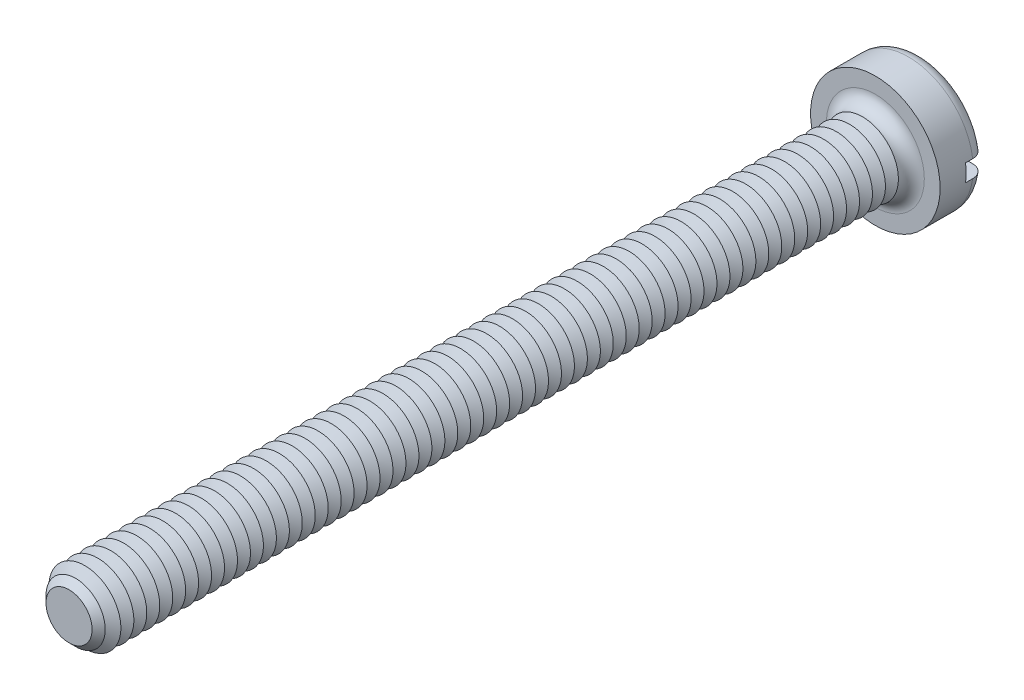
from build123d import *

# Parameters (mm, degrees)
SKETCH3_R           = 2.25
BOSS_EXTRUDE2_DEPTH = 1.6
SKETCH4_R           = 1.25
BOSS_EXTRUDE3_DEPTH = 28
FILLET1_R           = 0.45
CHAMFER1_SIZE       = 0.45
LPATTERN1_COUNT     = 61
LPATTERN1_PITCH     = 0.45
SKETCH8_W           = 4.5
SKETCH8_H           = 0.6
CUT_EXTRUDE1_DEPTH  = 0.7


with BuildPart() as part:
    # Sketch3 → Boss-Extrude2 (new body)
    with BuildSketch(Plane.XY):
        Circle(SKETCH3_R)
    extrude(amount=-BOSS_EXTRUDE2_DEPTH)

    # Sketch4 → Boss-Extrude3 (add)
    with BuildSketch(Plane.XY):
        Circle(SKETCH4_R)
    extrude(amount=BOSS_EXTRUDE3_DEPTH)

    # Fillet1
    fillet1_edges = [part.edges().sort_by_distance(p)[0] for p in [
        (-2.25, 0, -1.6),
        (-1.25, 0, 0),
    ]]
    fillet(fillet1_edges, radius=FILLET1_R)

    # Chamfer1
    chamfer1_edges = [part.edges().sort_by_distance(p)[0] for p in [
        (-1.25, 0, 28),
    ]]
    chamfer(chamfer1_edges, length=CHAMFER1_SIZE)

    # Sketch6 → Cut-Revolve1 (revolve, cut)
    with BuildSketch(Plane(origin=(0, 0, 0), x_dir=(0, 0, -1), z_dir=(1, 0, 0)), mode=Mode.PRIVATE) as cut_revolve1_sk:
        Polygon((-0.45, 1.25), (-0.675, 0.860288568), (-0.9, 1.25), align=None)
    cut_revolve1 = revolve(cut_revolve1_sk.sketch.rotate(Axis((0, 0, -1.694361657), (0, 0, 1)), 90), axis=Axis((0, 0, -1.694361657), (0, 0, 1)), mode=Mode.SUBTRACT)

    # LPattern1: Cut-Revolve1 ×61
    with Locations(*[(0, 0, i * LPATTERN1_PITCH) for i in range(1, LPATTERN1_COUNT)]):
        add(cut_revolve1, mode=Mode.SUBTRACT)

    # Sketch8 → Cut-Extrude1 (cut)
    with BuildSketch(Plane(origin=(0, 0, -1.6), x_dir=(-1, 0, 0), z_dir=(0, 0, -1))):
        Rectangle(SKETCH8_W, SKETCH8_H)
    extrude(amount=-CUT_EXTRUDE1_DEPTH, mode=Mode.SUBTRACT)


solid = part.part
